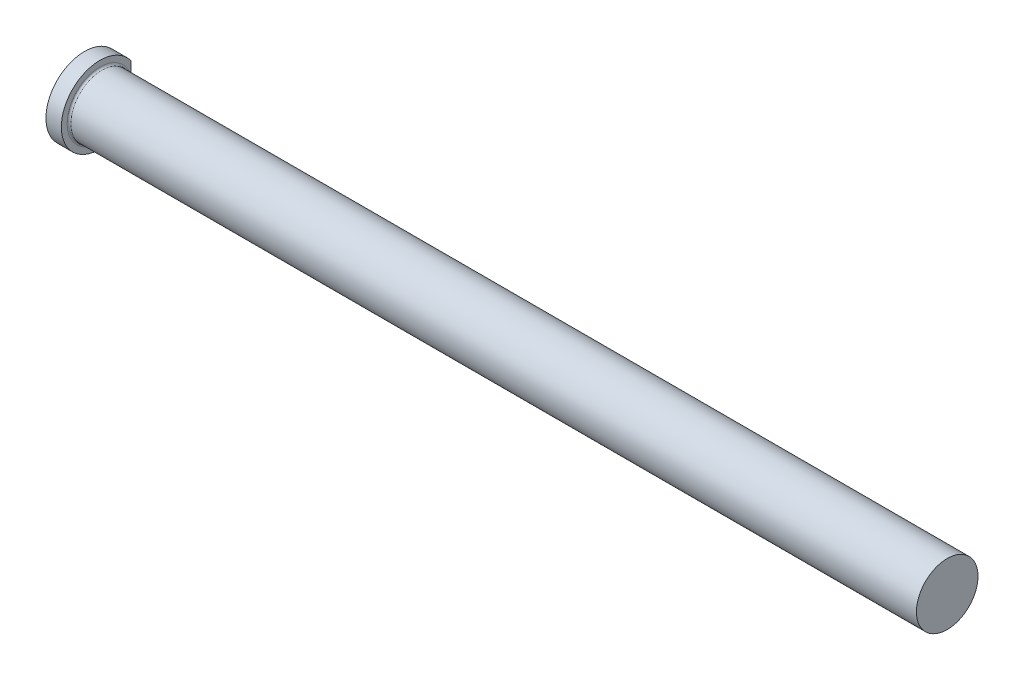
ISO-10303-21;
HEADER;
FILE_DESCRIPTION(('STEP AP214'),'2;1');
FILE_NAME('part.step','',(''),(''),'','','');
FILE_SCHEMA(('AUTOMOTIVE_DESIGN { 1 0 10303 214 1 1 1 1 }'));
ENDSEC;
DATA;
#1=APPLICATION_CONTEXT('core data for automotive mechanical design processes');
#2=APPLICATION_PROTOCOL_DEFINITION('international standard','automotive_design',2000,#1);
#3=PRODUCT_CONTEXT('',#1,'mechanical');
#4=PRODUCT('Part','Part','',(#3));
#5=PRODUCT_RELATED_PRODUCT_CATEGORY('part','',(#4));
#6=PRODUCT_DEFINITION_FORMATION('','',#4);
#7=PRODUCT_DEFINITION_CONTEXT('part definition',#1,'design');
#8=PRODUCT_DEFINITION('design','',#6,#7);
#9=PRODUCT_DEFINITION_SHAPE('','',#8);
#10=(LENGTH_UNIT() NAMED_UNIT(*) SI_UNIT(.MILLI.,.METRE.));
#11=(NAMED_UNIT(*) PLANE_ANGLE_UNIT() SI_UNIT($,.RADIAN.));
#12=(NAMED_UNIT(*) SI_UNIT($,.STERADIAN.) SOLID_ANGLE_UNIT());
#13=UNCERTAINTY_MEASURE_WITH_UNIT(LENGTH_MEASURE(1.E-05),#10,'distance_accuracy_value','');
#14=(GEOMETRIC_REPRESENTATION_CONTEXT(3) GLOBAL_UNCERTAINTY_ASSIGNED_CONTEXT((#13)) GLOBAL_UNIT_ASSIGNED_CONTEXT((#10,
#11,#12)) REPRESENTATION_CONTEXT('',''));
#15=CARTESIAN_POINT('',(0.,0.,0.));
#16=DIRECTION('',(0.,0.,1.));
#17=DIRECTION('',(1.,0.,0.));
#18=AXIS2_PLACEMENT_3D('',#15,#16,#17);
#19=CARTESIAN_POINT('',(0.,0.,0.));
#20=DIRECTION('',(1.,0.,0.));
#21=DIRECTION('',(0.,1.,0.));
#22=AXIS2_PLACEMENT_3D('',#19,#20,#21);
#23=PLANE('',#22);
#24=DIRECTION('',(0.,1.,0.));
#25=VECTOR('',#24,1.);
#26=CARTESIAN_POINT('',(0.,0.,-12.87145));
#27=LINE('',#26,#25);
#28=CARTESIAN_POINT('',(0.,-9.29200731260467,-12.87145));
#29=VERTEX_POINT('',#28);
#30=CARTESIAN_POINT('',(0.,9.29200731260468,-12.87145));
#31=VERTEX_POINT('',#30);
#32=EDGE_CURVE('E49',#29,#31,#27,.T.);
#33=ORIENTED_EDGE('',*,*,#32,.F.);
#34=CARTESIAN_POINT('',(0.,0.,0.));
#35=DIRECTION('',(-1.,0.,0.));
#36=DIRECTION('',(0.,-1.,0.));
#37=AXIS2_PLACEMENT_3D('',#34,#35,#36);
#38=CIRCLE('',#37,15.875);
#39=EDGE_CURVE('E43',#29,#31,#38,.T.);
#40=ORIENTED_EDGE('',*,*,#39,.T.);
#41=EDGE_LOOP('',(#33,#40));
#42=FACE_BOUND('',#41,.T.);
#43=ADVANCED_FACE('F32',(#42),#23,.F.);
#44=CARTESIAN_POINT('',(355.6,0.,0.));
#45=DIRECTION('',(-1.,0.,0.));
#46=DIRECTION('',(0.,-1.,0.));
#47=AXIS2_PLACEMENT_3D('',#44,#45,#46);
#48=CYLINDRICAL_SURFACE('',#47,15.875);
#49=DIRECTION('',(-1.,0.,0.));
#50=VECTOR('',#49,1.);
#51=CARTESIAN_POINT('',(355.6,-9.29200731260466,-12.87145));
#52=LINE('',#51,#50);
#53=CARTESIAN_POINT('',(6.35000000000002,-9.29200731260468,-12.87145));
#54=VERTEX_POINT('',#53);
#55=EDGE_CURVE('E87',#54,#29,#52,.T.);
#56=ORIENTED_EDGE('',*,*,#55,.F.);
#57=CARTESIAN_POINT('',(6.35000000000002,0.,0.));
#58=DIRECTION('',(-1.,0.,0.));
#59=DIRECTION('',(0.,-1.,0.));
#60=AXIS2_PLACEMENT_3D('',#57,#58,#59);
#61=CIRCLE('',#60,15.875);
#62=CARTESIAN_POINT('',(6.35000000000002,9.29200731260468,-12.87145));
#63=VERTEX_POINT('',#62);
#64=EDGE_CURVE('E75',#54,#63,#61,.T.);
#65=ORIENTED_EDGE('',*,*,#64,.T.);
#66=DIRECTION('',(-1.,0.,0.));
#67=VECTOR('',#66,1.);
#68=CARTESIAN_POINT('',(355.6,9.29200731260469,-12.87145));
#69=LINE('',#68,#67);
#70=EDGE_CURVE('E56',#31,#63,#69,.F.);
#71=ORIENTED_EDGE('',*,*,#70,.F.);
#72=ORIENTED_EDGE('',*,*,#39,.F.);
#73=EDGE_LOOP('',(#56,#65,#71,#72));
#74=FACE_BOUND('',#73,.T.);
#75=ADVANCED_FACE('F97',(#74),#48,.T.);
#76=CARTESIAN_POINT('',(6.35,15.875,0.));
#77=DIRECTION('',(-1.,0.,0.));
#78=DIRECTION('',(0.,-1.,0.));
#79=AXIS2_PLACEMENT_3D('',#76,#77,#78);
#80=PLANE('',#79);
#81=DIRECTION('',(0.,-1.,0.));
#82=VECTOR('',#81,1.);
#83=CARTESIAN_POINT('',(6.35,15.875,-12.87145));
#84=LINE('',#83,#82);
#85=CARTESIAN_POINT('',(6.35000000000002,4.00805239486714,-12.87145));
#86=VERTEX_POINT('',#85);
#87=EDGE_CURVE('E84',#63,#86,#84,.T.);
#88=ORIENTED_EDGE('',*,*,#87,.F.);
#89=ORIENTED_EDGE('',*,*,#64,.F.);
#90=CARTESIAN_POINT('',(6.35,-4.00805239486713,-12.87145));
#91=VERTEX_POINT('',#90);
#92=EDGE_CURVE('E80',#91,#54,#84,.T.);
#93=ORIENTED_EDGE('',*,*,#92,.F.);
#94=CARTESIAN_POINT('',(6.35000000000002,0.,0.));
#95=DIRECTION('',(-1.,0.,0.));
#96=DIRECTION('',(0.,-1.,0.));
#97=AXIS2_PLACEMENT_3D('',#94,#95,#96);
#98=CIRCLE('',#97,13.48105);
#99=EDGE_CURVE('E70',#91,#86,#98,.T.);
#100=ORIENTED_EDGE('',*,*,#99,.T.);
#101=EDGE_LOOP('',(#88,#89,#93,#100));
#102=FACE_BOUND('',#101,.T.);
#103=ADVANCED_FACE('F81',(#102),#80,.F.);
#104=CARTESIAN_POINT('',(7.1374,0.,0.));
#105=DIRECTION('',(-1.,0.,0.));
#106=DIRECTION('',(0.,-1.,0.));
#107=AXIS2_PLACEMENT_3D('',#104,#105,#106);
#108=TOROIDAL_SURFACE('',#107,13.48105,0.7874);
#109=CARTESIAN_POINT('',(7.13740000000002,0.,0.));
#110=DIRECTION('',(-1.,0.,0.));
#111=DIRECTION('',(0.,-1.,0.));
#112=AXIS2_PLACEMENT_3D('',#109,#110,#111);
#113=CIRCLE('',#112,12.69365);
#114=CARTESIAN_POINT('',(7.13740000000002,-12.69365,0.));
#115=VERTEX_POINT('',#114);
#116=EDGE_CURVE('E76',#115,#115,#113,.T.);
#117=ORIENTED_EDGE('',*,*,#116,.T.);
#118=EDGE_LOOP('',(#117));
#119=FACE_BOUND('',#118,.T.);
#120=CARTESIAN_POINT('',(6.63901601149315,0.,-12.87145));
#121=CARTESIAN_POINT('',(6.63902132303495,-0.131296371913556,-12.87145));
#122=CARTESIAN_POINT('',(6.63652777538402,-0.262590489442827,-12.87145));
#123=CARTESIAN_POINT('',(6.62694765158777,-0.525070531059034,-12.87145));
#124=CARTESIAN_POINT('',(6.61985873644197,-0.656256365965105,-12.87145));
#125=CARTESIAN_POINT('',(6.60203481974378,-0.918802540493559,-12.87145));
#126=CARTESIAN_POINT('',(6.5912879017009,-1.05016203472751,-12.87145));
#127=CARTESIAN_POINT('',(6.56740792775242,-1.31263453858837,-12.87145));
#128=CARTESIAN_POINT('',(6.55427526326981,-1.4437475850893,-12.87145));
#129=CARTESIAN_POINT('',(6.51879783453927,-1.783272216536,-12.87145));
#130=CARTESIAN_POINT('',(6.49559416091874,-1.9915910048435,-12.87145));
#131=CARTESIAN_POINT('',(6.45086166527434,-2.40847105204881,-12.87145));
#132=CARTESIAN_POINT('',(6.42933330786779,-2.61703236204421,-12.87145));
#133=CARTESIAN_POINT('',(6.39201166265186,-3.03426967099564,-12.87145));
#134=CARTESIAN_POINT('',(6.37620618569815,-3.24294446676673,-12.87145));
#135=CARTESIAN_POINT('',(6.35994046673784,-3.5563015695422,-12.87145));
#136=CARTESIAN_POINT('',(6.35575909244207,-3.66078526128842,-12.87145));
#137=CARTESIAN_POINT('',(6.35050629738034,-3.86982687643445,-12.87145));
#138=CARTESIAN_POINT('',(6.34943455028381,-3.97438479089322,-12.87145));
#139=CARTESIAN_POINT('',(6.35114428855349,-4.18417081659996,-12.87145));
#140=CARTESIAN_POINT('',(6.3539513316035,-4.28939878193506,-12.87145));
#141=CARTESIAN_POINT('',(6.36441797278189,-4.49969144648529,-12.87145));
#142=CARTESIAN_POINT('',(6.37208027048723,-4.60475602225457,-12.87145));
#143=CARTESIAN_POINT('',(6.39357462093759,-4.81463199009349,-12.87145));
#144=CARTESIAN_POINT('',(6.4074275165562,-4.91944131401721,-12.87145));
#145=CARTESIAN_POINT('',(6.44312799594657,-5.127650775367,-12.87145));
#146=CARTESIAN_POINT('',(6.46496519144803,-5.23105256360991,-12.87145));
#147=CARTESIAN_POINT('',(6.50611685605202,-5.384616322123,-12.87145));
#148=CARTESIAN_POINT('',(6.5213572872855,-5.43586758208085,-12.87145));
#149=CARTESIAN_POINT('',(6.55524832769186,-5.53721792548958,-12.87145));
#150=CARTESIAN_POINT('',(6.57389677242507,-5.5873177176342,-12.87145));
#151=CARTESIAN_POINT('',(6.61524823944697,-5.68540191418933,-12.87145));
#152=CARTESIAN_POINT('',(6.63792012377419,-5.73339926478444,-12.87145));
#153=CARTESIAN_POINT('',(6.68848140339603,-5.82651518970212,-12.87145));
#154=CARTESIAN_POINT('',(6.71635661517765,-5.87164115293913,-12.87145));
#155=CARTESIAN_POINT('',(6.76839599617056,-5.94263610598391,-12.87145));
#156=CARTESIAN_POINT('',(6.79066237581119,-5.96988259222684,-12.87145));
#157=CARTESIAN_POINT('',(6.83876581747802,-6.02106198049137,-12.87145));
#158=CARTESIAN_POINT('',(6.86459680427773,-6.04500038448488,-12.87145));
#159=CARTESIAN_POINT('',(6.91138770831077,-6.0809263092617,-12.87145));
#160=CARTESIAN_POINT('',(6.93127979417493,-6.09429212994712,-12.87145));
#161=CARTESIAN_POINT('',(6.97289929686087,-6.11779898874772,-12.87145));
#162=CARTESIAN_POINT('',(6.9946240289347,-6.1279446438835,-12.87145));
#163=CARTESIAN_POINT('',(7.03581523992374,-6.14274231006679,-12.87145));
#164=CARTESIAN_POINT('',(7.05505096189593,-6.14802964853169,-12.87145));
#165=CARTESIAN_POINT('',(7.09413879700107,-6.15527961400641,-12.87145));
#166=CARTESIAN_POINT('',(7.11399038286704,-6.15724500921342,-12.87145));
#167=CARTESIAN_POINT('',(7.15376353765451,-6.15765903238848,-12.87145));
#168=CARTESIAN_POINT('',(7.17368516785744,-6.15610195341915,-12.87145));
#169=CARTESIAN_POINT('',(7.21297172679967,-6.14961872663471,-12.87145));
#170=CARTESIAN_POINT('',(7.23233622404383,-6.14469003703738,-12.87145));
#171=CARTESIAN_POINT('',(7.27463364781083,-6.13033797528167,-12.87145));
#172=CARTESIAN_POINT('',(7.29729254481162,-6.12011425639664,-12.87145));
#173=CARTESIAN_POINT('',(7.34065958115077,-6.09615091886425,-12.87145));
#174=CARTESIAN_POINT('',(7.36136382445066,-6.08240447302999,-12.87145));
#175=CARTESIAN_POINT('',(7.41178822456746,-6.04392346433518,-12.87145));
#176=CARTESIAN_POINT('',(7.44008369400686,-6.01734046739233,-12.87145));
#177=CARTESIAN_POINT('',(7.49243025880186,-5.96031419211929,-12.87145));
#178=CARTESIAN_POINT('',(7.51647046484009,-5.92986134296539,-12.87145));
#179=CARTESIAN_POINT('',(7.56029936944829,-5.8675234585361,-12.87145));
#180=CARTESIAN_POINT('',(7.58019953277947,-5.83571547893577,-12.87145));
#181=CARTESIAN_POINT('',(7.61726087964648,-5.77052540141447,-12.87145));
#182=CARTESIAN_POINT('',(7.63441939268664,-5.73714180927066,-12.87145));
#183=CARTESIAN_POINT('',(7.66645524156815,-5.66922195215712,-12.87145));
#184=CARTESIAN_POINT('',(7.68132761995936,-5.63468337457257,-12.87145));
#185=CARTESIAN_POINT('',(7.70908557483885,-5.56484155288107,-12.87145));
#186=CARTESIAN_POINT('',(7.721971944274,-5.5295386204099,-12.87145));
#187=CARTESIAN_POINT('',(7.75169433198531,-5.44164219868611,-12.87145));
#188=CARTESIAN_POINT('',(7.76754280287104,-5.38871527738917,-12.87145));
#189=CARTESIAN_POINT('',(7.79621163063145,-5.28203971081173,-12.87145));
#190=CARTESIAN_POINT('',(7.80903054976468,-5.22829068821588,-12.87145));
#191=CARTESIAN_POINT('',(7.84371872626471,-5.06605703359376,-12.87145));
#192=CARTESIAN_POINT('',(7.86176647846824,-4.95675429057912,-12.87145));
#193=CARTESIAN_POINT('',(7.89038886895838,-4.7367170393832,-12.87145));
#194=CARTESIAN_POINT('',(7.90092702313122,-4.62597816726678,-12.87145));
#195=CARTESIAN_POINT('',(7.91608694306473,-4.40426390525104,-12.87145));
#196=CARTESIAN_POINT('',(7.92071660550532,-4.29328903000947,-12.87145));
#197=CARTESIAN_POINT('',(7.92664947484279,-4.00813540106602,-12.87145));
#198=CARTESIAN_POINT('',(7.92456489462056,-3.83389458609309,-12.87145));
#199=CARTESIAN_POINT('',(7.91243337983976,-3.48566556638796,-12.87145));
#200=CARTESIAN_POINT('',(7.90238273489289,-3.31167751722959,-12.87145));
#201=CARTESIAN_POINT('',(7.86411756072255,-2.78937264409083,-12.87145));
#202=CARTESIAN_POINT('',(7.8278010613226,-2.44170192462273,-12.87145));
#203=CARTESIAN_POINT('',(7.7714576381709,-1.92157757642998,-12.87145));
#204=CARTESIAN_POINT('',(7.75242589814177,-1.74895735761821,-12.87145));
#205=CARTESIAN_POINT('',(7.71630755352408,-1.40347686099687,-12.87145));
#206=CARTESIAN_POINT('',(7.69922113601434,-1.23061656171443,-12.87145));
#207=CARTESIAN_POINT('',(7.66995191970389,-0.88508870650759,-12.87145));
#208=CARTESIAN_POINT('',(7.65775152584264,-0.712422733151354,-12.87145));
#209=CARTESIAN_POINT('',(7.64084885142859,-0.366744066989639,-12.87145));
#210=CARTESIAN_POINT('',(7.63614431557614,-0.193731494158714,-12.87145));
#211=CARTESIAN_POINT('',(7.63546455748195,0.152240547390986,-12.87145));
#212=CARTESIAN_POINT('',(7.63948571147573,0.325200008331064,-12.87145));
#213=CARTESIAN_POINT('',(7.65518658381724,0.670790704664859,-12.87145));
#214=CARTESIAN_POINT('',(7.66686854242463,0.843421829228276,-12.87145));
#215=CARTESIAN_POINT('',(7.69532907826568,1.18885355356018,-12.87145));
#216=CARTESIAN_POINT('',(7.71212559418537,1.36165258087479,-12.87145));
#217=CARTESIAN_POINT('',(7.74788855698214,1.70699097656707,-12.87145));
#218=CARTESIAN_POINT('',(7.76685482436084,1.8795303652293,-12.87145));
#219=CARTESIAN_POINT('',(7.82321230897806,2.39861595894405,-12.87145));
#220=CARTESIAN_POINT('',(7.85990953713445,2.74529036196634,-12.87145));
#221=CARTESIAN_POINT('',(7.89944569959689,3.26613606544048,-12.87145));
#222=CARTESIAN_POINT('',(7.91003583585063,3.43967015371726,-12.87145));
#223=CARTESIAN_POINT('',(7.92354087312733,3.78701711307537,-12.87145));
#224=CARTESIAN_POINT('',(7.92645920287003,3.96082982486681,-12.87145));
#225=CARTESIAN_POINT('',(7.922579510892,4.22167151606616,-12.87145));
#226=CARTESIAN_POINT('',(7.91990063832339,4.30875968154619,-12.87145));
#227=CARTESIAN_POINT('',(7.91120561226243,4.48282547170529,-12.87145));
#228=CARTESIAN_POINT('',(7.90518767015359,4.5698030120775,-12.87145));
#229=CARTESIAN_POINT('',(7.88913802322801,4.74310097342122,-12.87145));
#230=CARTESIAN_POINT('',(7.87911999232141,4.82942262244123,-12.87145));
#231=CARTESIAN_POINT('',(7.85414498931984,5.00132267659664,-12.87145));
#232=CARTESIAN_POINT('',(7.83919090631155,5.08690148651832,-12.87145));
#233=CARTESIAN_POINT('',(7.80608839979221,5.24231674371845,-12.87145));
#234=CARTESIAN_POINT('',(7.78891513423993,5.31235625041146,-12.87145));
#235=CARTESIAN_POINT('',(7.74907086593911,5.4511341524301,-12.87145));
#236=CARTESIAN_POINT('',(7.72638144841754,5.51986734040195,-12.87145));
#237=CARTESIAN_POINT('',(7.67353823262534,5.65551176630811,-12.87145));
#238=CARTESIAN_POINT('',(7.64329886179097,5.72239160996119,-12.87145));
#239=CARTESIAN_POINT('',(7.59046436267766,5.81841177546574,-12.87145));
#240=CARTESIAN_POINT('',(7.57166213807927,5.84963056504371,-12.87145));
#241=CARTESIAN_POINT('',(7.53105828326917,5.91003065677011,-12.87145));
#242=CARTESIAN_POINT('',(7.5092617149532,5.9392152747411,-12.87145));
#243=CARTESIAN_POINT('',(7.46900181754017,5.98641815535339,-12.87145));
#244=CARTESIAN_POINT('',(7.45143859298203,6.00519920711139,-12.87145));
#245=CARTESIAN_POINT('',(7.41427505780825,6.04069662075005,-12.87145));
#246=CARTESIAN_POINT('',(7.39467305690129,6.05741124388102,-12.87145));
#247=CARTESIAN_POINT('',(7.3530698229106,6.08812617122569,-12.87145));
#248=CARTESIAN_POINT('',(7.33104455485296,6.10209457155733,-12.87145));
#249=CARTESIAN_POINT('',(7.28488159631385,6.12595278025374,-12.87145));
#250=CARTESIAN_POINT('',(7.26074918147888,6.13585243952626,-12.87145));
#251=CARTESIAN_POINT('',(7.21706500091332,6.14863545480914,-12.87145));
#252=CARTESIAN_POINT('',(7.19784407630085,6.15264493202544,-12.87145));
#253=CARTESIAN_POINT('',(7.15900089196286,6.15733897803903,-12.87145));
#254=CARTESIAN_POINT('',(7.13937890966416,6.15802577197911,-12.87145));
#255=CARTESIAN_POINT('',(7.10031842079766,6.15600809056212,-12.87145));
#256=CARTESIAN_POINT('',(7.08087987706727,6.15330431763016,-12.87145));
#257=CARTESIAN_POINT('',(7.04270558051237,6.14476478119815,-12.87145));
#258=CARTESIAN_POINT('',(7.02397041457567,6.13892646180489,-12.87145));
#259=CARTESIAN_POINT('',(6.98153478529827,6.12219554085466,-12.87145));
#260=CARTESIAN_POINT('',(6.9582444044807,6.11026947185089,-12.87145));
#261=CARTESIAN_POINT('',(6.91386846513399,6.08285938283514,-12.87145));
#262=CARTESIAN_POINT('',(6.89278793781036,6.06736748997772,-12.87145));
#263=CARTESIAN_POINT('',(6.8405943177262,6.0235996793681,-12.87145));
#264=CARTESIAN_POINT('',(6.81120408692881,5.99328951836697,-12.87145));
#265=CARTESIAN_POINT('',(6.75715840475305,5.9287481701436,-12.87145));
#266=CARTESIAN_POINT('',(6.73251523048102,5.89450717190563,-12.87145));
#267=CARTESIAN_POINT('',(6.68715286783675,5.82368800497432,-12.87145));
#268=CARTESIAN_POINT('',(6.6664231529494,5.78711647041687,-12.87145));
#269=CARTESIAN_POINT('',(6.6280852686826,5.71235390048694,-12.87145));
#270=CARTESIAN_POINT('',(6.61048030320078,5.67416125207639,-12.87145));
#271=CARTESIAN_POINT('',(6.57784332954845,5.59660802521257,-12.87145));
#272=CARTESIAN_POINT('',(6.56281692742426,5.55724511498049,-12.87145));
#273=CARTESIAN_POINT('',(6.53498447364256,5.47777096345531,-12.87145));
#274=CARTESIAN_POINT('',(6.52217745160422,5.43766005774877,-12.87145));
#275=CARTESIAN_POINT('',(6.49228608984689,5.33587999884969,-12.87145));
#276=CARTESIAN_POINT('',(6.47644094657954,5.27384739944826,-12.87145));
#277=CARTESIAN_POINT('',(6.44830209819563,5.14897260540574,-12.87145));
#278=CARTESIAN_POINT('',(6.43601015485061,5.0861300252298,-12.87145));
#279=CARTESIAN_POINT('',(6.4035142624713,4.89663621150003,-12.87145));
#280=CARTESIAN_POINT('',(6.38774551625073,4.76922420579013,-12.87145));
#281=CARTESIAN_POINT('',(6.36474022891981,4.51310631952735,-12.87145));
#282=CARTESIAN_POINT('',(6.3575451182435,4.38439716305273,-12.87145));
#283=CARTESIAN_POINT('',(6.34974650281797,4.12696540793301,-12.87145));
#284=CARTESIAN_POINT('',(6.34913454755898,3.99824303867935,-12.87145));
#285=CARTESIAN_POINT('',(6.35344737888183,3.70751753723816,-12.87145));
#286=CARTESIAN_POINT('',(6.35984930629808,3.54554136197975,-12.87145));
#287=CARTESIAN_POINT('',(6.37830004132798,3.22189669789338,-12.87145));
#288=CARTESIAN_POINT('',(6.39035025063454,3.060228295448,-12.87145));
#289=CARTESIAN_POINT('',(6.43212368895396,2.5751520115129,-12.87145));
#290=CARTESIAN_POINT('',(6.46744632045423,2.25225972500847,-12.87145));
#291=CARTESIAN_POINT('',(6.52000335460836,1.76890468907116,-12.87145));
#292=CARTESIAN_POINT('',(6.53739921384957,1.60843434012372,-12.87145));
#293=CARTESIAN_POINT('',(6.56990040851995,1.28724009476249,-12.87145));
#294=CARTESIAN_POINT('',(6.58500565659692,1.12651618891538,-12.87145));
#295=CARTESIAN_POINT('',(6.61055942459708,0.804969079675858,-12.87145));
#296=CARTESIAN_POINT('',(6.62101628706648,0.644146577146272,-12.87145));
#297=CARTESIAN_POINT('',(6.63524063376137,0.322214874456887,-12.87145));
#298=CARTESIAN_POINT('',(6.63900949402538,0.161105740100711,-12.87145));
#299=CARTESIAN_POINT('',(6.63901601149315,0.,-12.87145));
#300=B_SPLINE_CURVE_WITH_KNOTS('',3,(#120,#121,#122,#123,#124,#125,#126,#127,#128,#129,#130,
#131,#132,#133,#134,#135,#136,#137,#138,#139,#140,#141,#142,#143,#144,#145,#146,#147,#148,#149,
#150,#151,#152,#153,#154,#155,#156,#157,#158,#159,#160,#161,#162,#163,#164,#165,#166,#167,#168,
#169,#170,#171,#172,#173,#174,#175,#176,#177,#178,#179,#180,#181,#182,#183,#184,#185,#186,#187,
#188,#189,#190,#191,#192,#193,#194,#195,#196,#197,#198,#199,#200,#201,#202,#203,#204,#205,#206,
#207,#208,#209,#210,#211,#212,#213,#214,#215,#216,#217,#218,#219,#220,#221,#222,#223,#224,#225,
#226,#227,#228,#229,#230,#231,#232,#233,#234,#235,#236,#237,#238,#239,#240,#241,#242,#243,#244,
#245,#246,#247,#248,#249,#250,#251,#252,#253,#254,#255,#256,#257,#258,#259,#260,#261,#262,#263,
#264,#265,#266,#267,#268,#269,#270,#271,#272,#273,#274,#275,#276,#277,#278,#279,#280,#281,#282,
#283,#284,#285,#286,#287,#288,#289,#290,#291,#292,#293,#294,#295,#296,#297,#298,#299),
.UNSPECIFIED.,.T.,.F.,(4,2,2,2,2,2,2,2,2,2,2,2,2,2,2,2,2,2,2,2,2,2,2,2,2,2,2,2,2,2,2,2,2,2,2,2,
2,2,2,2,2,2,2,2,2,2,2,2,2,2,2,2,2,2,2,2,2,2,2,2,2,2,2,2,2,2,2,2,2,2,2,2,2,2,2,2,2,2,2,2,2,2,2,2,
2,2,2,2,2,4),(0.,0.393864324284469,0.787929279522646,1.18329044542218,1.5785868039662,
2.20740625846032,2.83639948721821,3.46404503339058,3.77771103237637,4.09134411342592,
4.40705363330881,4.72293884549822,5.03989570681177,5.35644163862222,5.51676011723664,
5.67697712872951,5.83600435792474,5.99460426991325,6.09993890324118,6.20509618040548,
6.27677072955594,6.34834204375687,6.40793229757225,6.46747286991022,6.52710997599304,
6.58679209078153,6.66095347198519,6.73525968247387,6.85107623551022,6.96718501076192,
7.07957686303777,7.19207753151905,7.30481881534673,7.41751496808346,7.58314078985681,
7.74884505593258,8.08078098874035,8.41431878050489,8.74741033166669,9.26988095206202,
9.7925950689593,10.8409771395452,11.3620002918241,11.8830735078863,12.4022530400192,
12.921276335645,13.440084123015,13.9590436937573,14.4798448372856,15.0006029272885,
16.0461641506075,16.5676264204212,17.0888555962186,17.3501938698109,17.6116722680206,
17.8722643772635,18.1327042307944,18.3488709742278,18.5657695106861,18.7852478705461,
18.894452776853,19.0034752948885,19.08049043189,19.1575699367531,19.2354979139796,
19.3132360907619,19.3718796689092,19.4304839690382,19.4890761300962,19.5477161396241,
19.6257734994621,19.7040048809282,19.8299507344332,19.9562180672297,20.0821407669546,
20.2081918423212,20.3345135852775,20.4607799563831,20.6527101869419,20.8447354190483,
21.229420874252,21.6159578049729,22.0019984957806,22.488160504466,22.9744432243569,
23.9487677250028,24.4330081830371,24.9172671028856,25.4006533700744,25.8839401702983),.UNSPECIFIED.);
#301=EDGE_CURVE('E12',#86,#91,#300,.T.);
#302=ORIENTED_EDGE('',*,*,#301,.F.);
#303=ORIENTED_EDGE('',*,*,#99,.F.);
#304=EDGE_LOOP('',(#302,#303));
#305=FACE_BOUND('',#304,.T.);
#306=ADVANCED_FACE('F72',(#119,#305),#108,.F.);
#307=CARTESIAN_POINT('',(355.6,0.,0.));
#308=DIRECTION('',(-1.,0.,0.));
#309=DIRECTION('',(0.,-1.,0.));
#310=AXIS2_PLACEMENT_3D('',#307,#308,#309);
#311=CYLINDRICAL_SURFACE('',#310,12.69365);
#312=ORIENTED_EDGE('',*,*,#116,.F.);
#313=EDGE_LOOP('',(#312));
#314=FACE_BOUND('',#313,.T.);
#315=CARTESIAN_POINT('',(355.6,0.,0.));
#316=DIRECTION('',(-1.,0.,0.));
#317=DIRECTION('',(0.,-1.,0.));
#318=AXIS2_PLACEMENT_3D('',#315,#316,#317);
#319=CIRCLE('',#318,12.69365);
#320=CARTESIAN_POINT('',(355.6,-12.69365,0.));
#321=VERTEX_POINT('',#320);
#322=EDGE_CURVE('E92',#321,#321,#319,.T.);
#323=ORIENTED_EDGE('',*,*,#322,.T.);
#324=EDGE_LOOP('',(#323));
#325=FACE_BOUND('',#324,.T.);
#326=ADVANCED_FACE('F107',(#314,#325),#311,.T.);
#327=CARTESIAN_POINT('',(355.6,12.69365,0.));
#328=DIRECTION('',(-1.,0.,0.));
#329=DIRECTION('',(0.,-1.,0.));
#330=AXIS2_PLACEMENT_3D('',#327,#328,#329);
#331=PLANE('',#330);
#332=ORIENTED_EDGE('',*,*,#322,.F.);
#333=EDGE_LOOP('',(#332));
#334=FACE_BOUND('',#333,.T.);
#335=ADVANCED_FACE('F111',(#334),#331,.F.);
#336=CARTESIAN_POINT('',(0.,0.,-12.87145));
#337=DIRECTION('',(0.,0.,-1.));
#338=DIRECTION('',(0.,1.,0.));
#339=AXIS2_PLACEMENT_3D('',#336,#337,#338);
#340=PLANE('',#339);
#341=ORIENTED_EDGE('',*,*,#55,.T.);
#342=ORIENTED_EDGE('',*,*,#32,.T.);
#343=ORIENTED_EDGE('',*,*,#70,.T.);
#344=ORIENTED_EDGE('',*,*,#87,.T.);
#345=ORIENTED_EDGE('',*,*,#301,.T.);
#346=ORIENTED_EDGE('',*,*,#92,.T.);
#347=EDGE_LOOP('',(#341,#342,#343,#344,#345,#346));
#348=FACE_BOUND('',#347,.T.);
#349=ADVANCED_FACE('F86',(#348),#340,.T.);
#350=CLOSED_SHELL('',(#43,#75,#103,#306,#326,#335,#349));
#351=MANIFOLD_SOLID_BREP('B2',#350);
#352=ADVANCED_BREP_SHAPE_REPRESENTATION('',(#18,#351),#14);
#353=SHAPE_DEFINITION_REPRESENTATION(#9,#352);
ENDSEC;
END-ISO-10303-21;
